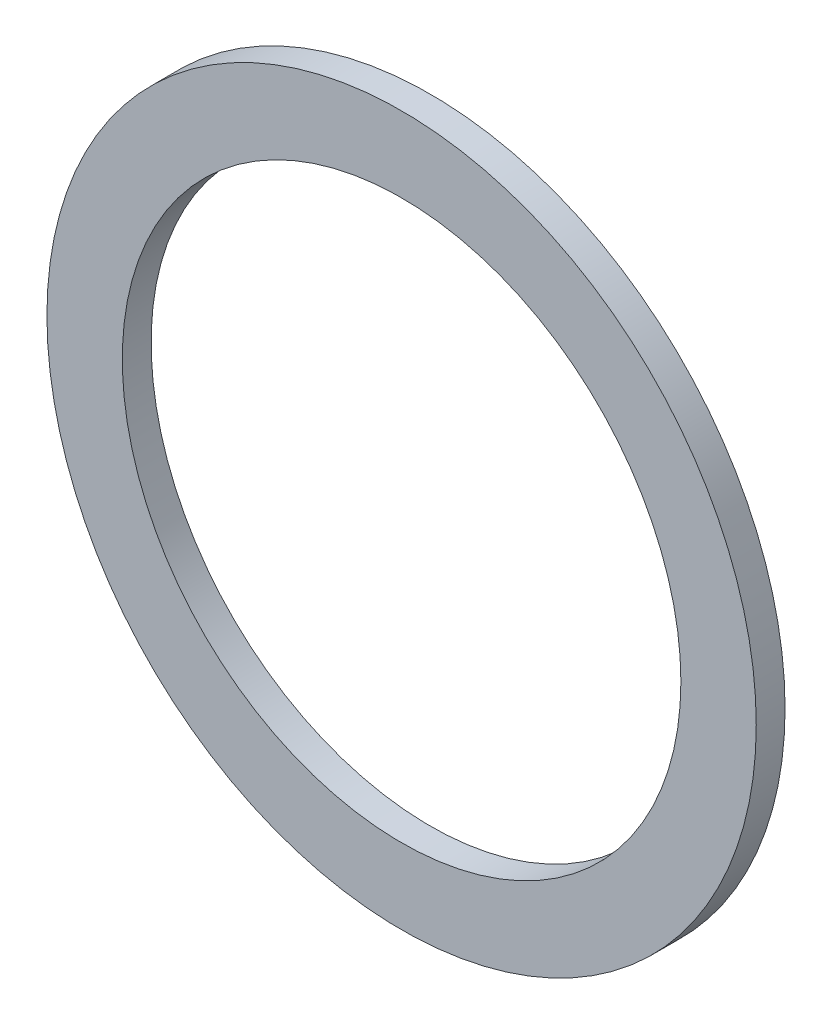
ISO-10303-21;
HEADER;
FILE_DESCRIPTION(('STEP AP214'),'2;1');
FILE_NAME('part.step','',(''),(''),'','','');
FILE_SCHEMA(('AUTOMOTIVE_DESIGN { 1 0 10303 214 1 1 1 1 }'));
ENDSEC;
DATA;
#1=APPLICATION_CONTEXT('core data for automotive mechanical design processes');
#2=APPLICATION_PROTOCOL_DEFINITION('international standard','automotive_design',2000,#1);
#3=PRODUCT_CONTEXT('',#1,'mechanical');
#4=PRODUCT('Part','Part','',(#3));
#5=PRODUCT_RELATED_PRODUCT_CATEGORY('part','',(#4));
#6=PRODUCT_DEFINITION_FORMATION('','',#4);
#7=PRODUCT_DEFINITION_CONTEXT('part definition',#1,'design');
#8=PRODUCT_DEFINITION('design','',#6,#7);
#9=PRODUCT_DEFINITION_SHAPE('','',#8);
#10=(LENGTH_UNIT() NAMED_UNIT(*) SI_UNIT(.MILLI.,.METRE.));
#11=(NAMED_UNIT(*) PLANE_ANGLE_UNIT() SI_UNIT($,.RADIAN.));
#12=(NAMED_UNIT(*) SI_UNIT($,.STERADIAN.) SOLID_ANGLE_UNIT());
#13=UNCERTAINTY_MEASURE_WITH_UNIT(LENGTH_MEASURE(1.E-05),#10,'distance_accuracy_value','');
#14=(GEOMETRIC_REPRESENTATION_CONTEXT(3) GLOBAL_UNCERTAINTY_ASSIGNED_CONTEXT((#13)) GLOBAL_UNIT_ASSIGNED_CONTEXT((#10,
#11,#12)) REPRESENTATION_CONTEXT('',''));
#15=CARTESIAN_POINT('',(0.,0.,0.));
#16=DIRECTION('',(0.,0.,1.));
#17=DIRECTION('',(1.,0.,0.));
#18=AXIS2_PLACEMENT_3D('',#15,#16,#17);
#19=CARTESIAN_POINT('',(0.,0.,0.65));
#20=DIRECTION('',(0.,0.,1.));
#21=DIRECTION('',(1.,0.,0.));
#22=AXIS2_PLACEMENT_3D('',#19,#20,#21);
#23=PLANE('',#22);
#24=CARTESIAN_POINT('',(0.,0.,0.65));
#25=DIRECTION('',(0.,0.,1.));
#26=DIRECTION('',(1.,0.,0.));
#27=AXIS2_PLACEMENT_3D('',#24,#25,#26);
#28=CIRCLE('',#27,8.);
#29=CARTESIAN_POINT('',(8.,0.,0.65));
#30=VERTEX_POINT('',#29);
#31=EDGE_CURVE('E10',#30,#30,#28,.T.);
#32=ORIENTED_EDGE('',*,*,#31,.T.);
#33=EDGE_LOOP('',(#32));
#34=FACE_BOUND('',#33,.T.);
#35=CARTESIAN_POINT('',(0.,0.,0.65));
#36=DIRECTION('',(0.,0.,1.));
#37=DIRECTION('',(1.,0.,0.));
#38=AXIS2_PLACEMENT_3D('',#35,#36,#37);
#39=CIRCLE('',#38,6.3);
#40=CARTESIAN_POINT('',(6.3,0.,0.65));
#41=VERTEX_POINT('',#40);
#42=EDGE_CURVE('E48',#41,#41,#39,.T.);
#43=ORIENTED_EDGE('',*,*,#42,.F.);
#44=EDGE_LOOP('',(#43));
#45=FACE_BOUND('',#44,.T.);
#46=ADVANCED_FACE('F37',(#34,#45),#23,.T.);
#47=CARTESIAN_POINT('',(0.,0.,0.));
#48=DIRECTION('',(0.,0.,1.));
#49=DIRECTION('',(1.,0.,0.));
#50=AXIS2_PLACEMENT_3D('',#47,#48,#49);
#51=PLANE('',#50);
#52=CARTESIAN_POINT('',(0.,0.,0.));
#53=DIRECTION('',(0.,0.,1.));
#54=DIRECTION('',(1.,0.,0.));
#55=AXIS2_PLACEMENT_3D('',#52,#53,#54);
#56=CIRCLE('',#55,8.);
#57=CARTESIAN_POINT('',(8.,0.,0.));
#58=VERTEX_POINT('',#57);
#59=EDGE_CURVE('E41',#58,#58,#56,.T.);
#60=ORIENTED_EDGE('',*,*,#59,.F.);
#61=EDGE_LOOP('',(#60));
#62=FACE_BOUND('',#61,.T.);
#63=CARTESIAN_POINT('',(0.,0.,0.));
#64=DIRECTION('',(0.,0.,1.));
#65=DIRECTION('',(1.,0.,0.));
#66=AXIS2_PLACEMENT_3D('',#63,#64,#65);
#67=CIRCLE('',#66,6.3);
#68=CARTESIAN_POINT('',(6.3,0.,0.));
#69=VERTEX_POINT('',#68);
#70=EDGE_CURVE('E50',#69,#69,#67,.T.);
#71=ORIENTED_EDGE('',*,*,#70,.T.);
#72=EDGE_LOOP('',(#71));
#73=FACE_BOUND('',#72,.T.);
#74=ADVANCED_FACE('F60',(#62,#73),#51,.F.);
#75=CARTESIAN_POINT('',(0.,0.,0.65));
#76=DIRECTION('',(0.,0.,-1.));
#77=DIRECTION('',(-1.,0.,0.));
#78=AXIS2_PLACEMENT_3D('',#75,#76,#77);
#79=CYLINDRICAL_SURFACE('',#78,8.);
#80=ORIENTED_EDGE('',*,*,#31,.F.);
#81=EDGE_LOOP('',(#80));
#82=FACE_BOUND('',#81,.T.);
#83=ORIENTED_EDGE('',*,*,#59,.T.);
#84=EDGE_LOOP('',(#83));
#85=FACE_BOUND('',#84,.T.);
#86=ADVANCED_FACE('F39',(#82,#85),#79,.T.);
#87=CARTESIAN_POINT('',(0.,0.,0.65));
#88=DIRECTION('',(0.,0.,-1.));
#89=DIRECTION('',(-1.,0.,0.));
#90=AXIS2_PLACEMENT_3D('',#87,#88,#89);
#91=CYLINDRICAL_SURFACE('',#90,6.3);
#92=ORIENTED_EDGE('',*,*,#42,.T.);
#93=EDGE_LOOP('',(#92));
#94=FACE_BOUND('',#93,.T.);
#95=ORIENTED_EDGE('',*,*,#70,.F.);
#96=EDGE_LOOP('',(#95));
#97=FACE_BOUND('',#96,.T.);
#98=ADVANCED_FACE('F56',(#94,#97),#91,.F.);
#99=CLOSED_SHELL('',(#46,#74,#86,#98));
#100=MANIFOLD_SOLID_BREP('B2',#99);
#101=ADVANCED_BREP_SHAPE_REPRESENTATION('',(#18,#100),#14);
#102=SHAPE_DEFINITION_REPRESENTATION(#9,#101);
ENDSEC;
END-ISO-10303-21;
